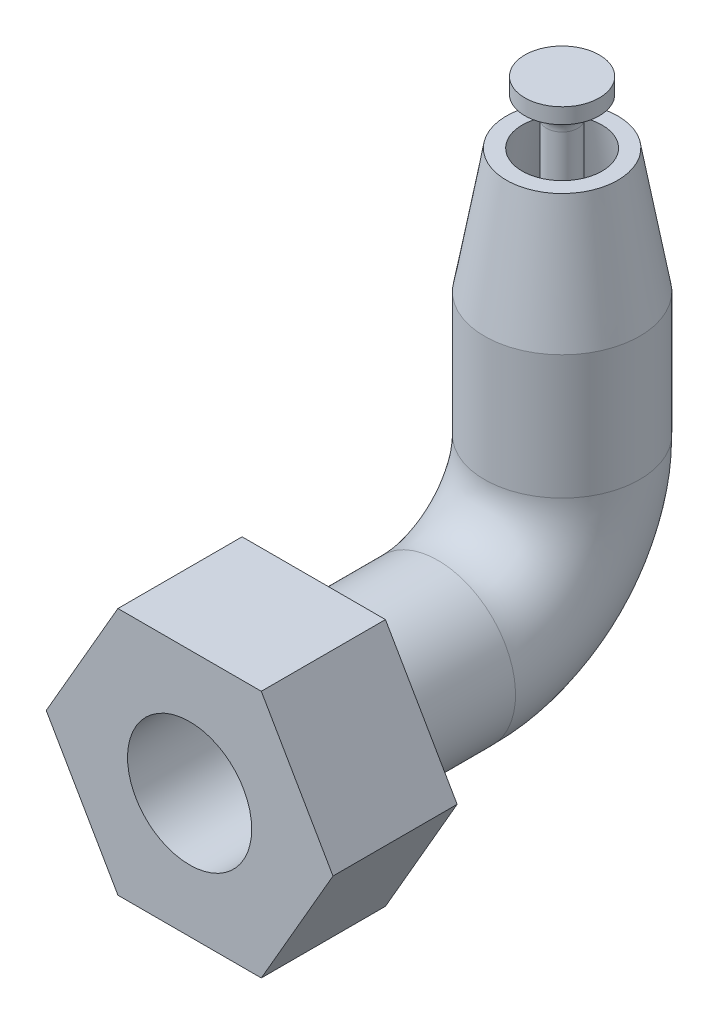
from build123d import *
from build123d.topology import SkipClean

# Parameters (mm, degrees)
SKETCH4_R           = 12.7
BOSS_EXTRUDE1_DEPTH = 25.4
SKETCH102_R         = 15.875
SKETCH102_R_2       = 12.7
SKETCH105_R         = 2.54
CUT_EXTRUDE1_DEPTH  = 31.75


with BuildPart() as part:
    # Sketch4 → Boss-Extrude1 (new body)
    with BuildSketch(Plane.XY):
        Polygon((29.329393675, 0), (14.664696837, 25.4), (-14.664696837, 25.4), (-29.329393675, 0), (-14.664696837, -25.4), (14.664696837, -25.4), align=None)
        Circle(SKETCH4_R, mode=Mode.SUBTRACT)
    extrude(amount=BOSS_EXTRUDE1_DEPTH)

    # Sweep3: sweep along a path in Sketch101
    with SkipClean():  # the faces are left unmerged after this step: merging them gives an invalid solid
        with BuildLine(Plane(origin=(0, 0, 0), x_dir=(0, 0, -1), z_dir=(1, 0, 0))) as sweep3_path:
            Line((0, 0), (25.4, 0))
            ThreePointArc((25.4, 0), (43.360512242, 7.439487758), (50.8, 25.4))
            Line((50.8, 25.4), (50.8, 50.8))
        # Sketch102 → Sweep3 (sweep)
        with BuildSketch(Plane(origin=(0, 0, 0), x_dir=(-1, 0, 0), z_dir=(0, 0, -1))):
            Circle(SKETCH102_R)
            Circle(SKETCH102_R_2, mode=Mode.SUBTRACT)
        sweep(path=sweep3_path.line)

    # Sketch104 → Revolve2 (revolve)
    with SkipClean():  # the faces are left unmerged after this step: merging them gives an invalid solid
        with BuildSketch(Plane(origin=(0, 0, 0), x_dir=(0, 0, -1), z_dir=(1, 0, 0)), mode=Mode.PRIVATE) as revolve2_sk:
            with BuildLine():
                Line((47.625, 81.28), (47.625, 53.975))
                Line((47.625, 53.975), (38.708817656, 53.975))
                Line((38.708817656, 53.975), (42.627684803, 76.2))
                Line((42.627684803, 76.2), (39.40370531, 76.2))
                Line((39.40370531, 76.2), (34.925, 50.8))
                Line((34.925, 50.8), (50.8, 50.8))
                Line((50.8, 50.8), (50.8, 88.9))
                Line((50.8, 88.9), (43.18, 88.9))
                Line((43.18, 88.9), (43.18, 85.725))
                ThreePointArc((43.18, 85.725), (46.323089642, 84.423089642), (47.625, 81.28))
            make_face()
        revolve(revolve2_sk.sketch.rotate(Axis((0, -949.2, -50.8), (0, 1, 0)), 180), axis=Axis((0, -949.2, -50.8), (0, 1, 0)))

    # Sketch105 → Cut-Extrude1 (cut)
    with SkipClean():  # the faces are left unmerged after this step: merging them gives an invalid solid
        with BuildSketch(Plane(origin=(0, 53.975, 0), x_dir=(1, 0, 0), z_dir=(0, 1, 0))):
            with Locations(Location((-8.89, 50.8, 0), (0, 0, 270))):
                Circle(SKETCH105_R)
            with Locations(Location((-4.445, 58.49896584, 0), (0, 0, 270))):
                Circle(SKETCH105_R)
            with Locations(Location((4.445, 58.49896584, 0), (0, 0, 270))):
                Circle(SKETCH105_R)
            with Locations(Location((8.89, 50.8, 0), (0, 0, 270))):
                Circle(SKETCH105_R)
            with Locations(Location((4.445, 43.10103416, 0), (0, 0, 270))):
                Circle(SKETCH105_R)
            with Locations(Location((-4.445, 43.10103416, 0), (0, 0, 270))):
                Circle(SKETCH105_R)
        extrude(amount=-CUT_EXTRUDE1_DEPTH, mode=Mode.SUBTRACT)


solid = part.part
